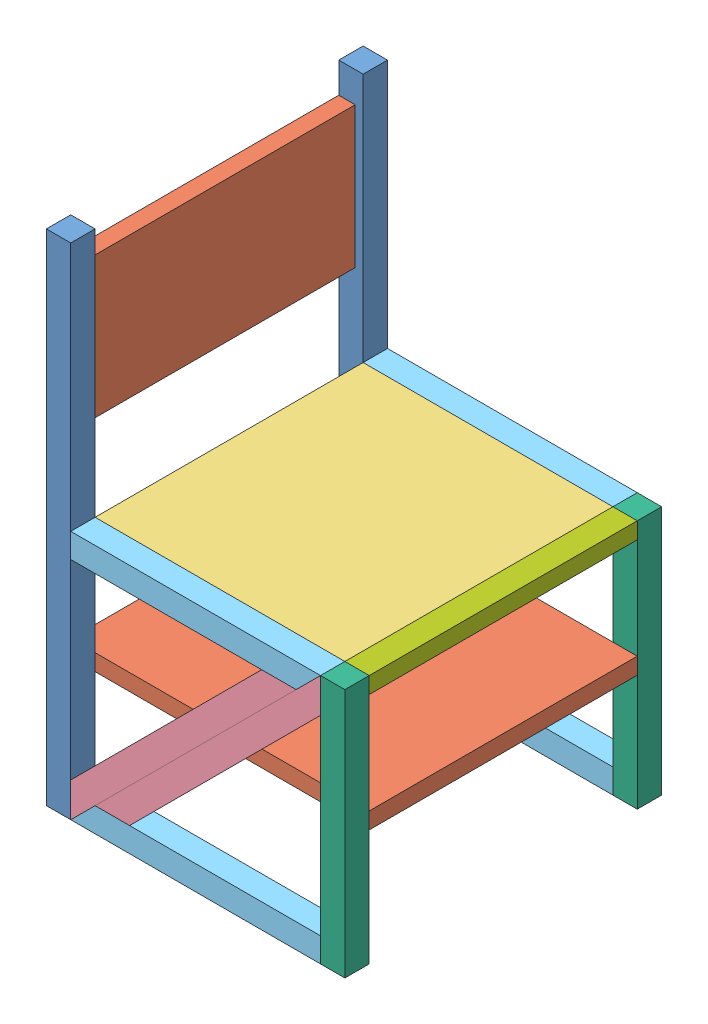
SolidWorks assembly montage animation.SLDASM, configuration Défaut (file format 7000). Lengths in mm.
Overall size (615.48 931.33 520).
19 component instances, 7 part files, 4 mates.
Components (placement in the parent):
- PARTIE MOBILE-1: PARTIE MOBILE.SLDASM [Défaut] at (271.4456 1355.9928 -665.5456) x (-1 0 0) z (0 0 1) size (450 820 520)
  - montant partie mobile-1: montant partie mobile.SLDPRT [Défaut] at (-165.2031 846.3507 -83.4097) x (-1 0 0) z (0 0 1) size (40 820 40)
  - PLATEFORME-1: PLATEFORME.SLDPRT [Défaut] at (66.2969 -142.1493 -563.4097) x (0 1 0) z (0 0 1) size (231.5 27 440)
  - ASSISE-1: ASSISE.SLDPRT [Défaut] at (-165.2031 463.3507 -603.4097) x (-1 0 0) z (0 1 0) size (410 440 27)
  - PLATEFORME-2: PLATEFORME.SLDPRT [Défaut] at (93.2969 847.3507 -563.4097) x (-1 0 0) z (0 0 1) size (231.5 27 440)
  - diagonle-2: diagonle.SLDPRT [Défaut] at (-575.2031 436.3507 -83.4097) size (370 370 40)
  - longeron-1: longeron.SLDPRT [Défaut] at (-575.2031 436.3507 -83.4097) size (410 40 40)
  - montant partie mobile-3: montant partie mobile.SLDPRT [Défaut] at (-165.2031 846.3507 -563.4097) x (-1 0 0) z (0 0 1) size (40 820 40)
  - diagonle-3: diagonle.SLDPRT [Défaut] at (-575.2031 436.3507 -563.4097) size (370 370 40)
  - longeron-2: longeron.SLDPRT [Défaut] at (-575.2031 436.3507 -563.4097) size (410 40 40)
- PARTIE FIXE^montage animation-1: PARTIE FIXE^montage animation.sldasm [Défaut] at (345.3756 628.2227 -748.9553) x (0.966698 -0.255919 0) z (0 0 1) size (501.27 511.51 520) (virtual)
  - longeron-1: longeron.SLDPRT [Défaut] at (118.5806 -91.2731 0) x (0.966698 0.255919 0) z (0 0 1) size (410 40 40)
  - diagonle-1: diagonle.SLDPRT [Défaut] at (118.5806 -91.2731 0) x (0.966698 0.255919 0) z (0 0 1) size (370 370 40)
  - MONTANT PARTIE fixe-1: MONTANT PARTIE fixe.SLDPRT [Défaut] at (118.5806 -91.2731 0) x (0.966698 0.255919 0) z (0 0 1) size (40 410 40)
  - MONTANT PARTIE fixe-2: MONTANT PARTIE fixe.SLDPRT [Défaut] at (118.5806 -91.2731 -480) x (0.966698 0.255919 0) z (0 0 1) size (40 410 40)
  - diagonle-2: diagonle.SLDPRT [Défaut] at (118.5806 -91.2731 -480) x (0.966698 0.255919 0) z (0 0 1) size (370 370 40)
  - longeron-2: longeron.SLDPRT [Défaut] at (118.5806 -91.2731 -480) x (0.966698 0.255919 0) z (0 0 1) size (410 40 40)
  - BARRE-1: BARRE.SLDPRT [Défaut] at (20.5636 278.9723 -520) x (0.966698 0.255919 0) z (0.255919 -0.966698 0) size (40 440 27)
  - PLATEFORME-1: PLATEFORME.SLDPRT [Défaut] at (118.8365 -92.2398 -480) x (0.966698 0.255919 0) z (0 0 1) size (231.5 27 440)
Mates (geometry in assembly coordinates):
- Coïncidente32: coincident: plane of PARTIE FIXE^montage animation-1/diagonle-1 through (436.6487 509.6421 -748.9553) normal (0 0 1); plane of ? through (391.6436 560.2394 -748.9553) normal (0 0 1)
- Coïncidente49: coincident anti-aligned: line of ? through (846.6487 946.6421 -748.9553) axis (0 0 -1); line of ? through (846.6487 946.6421 -1268.9553) axis (0 0 1)
- Coïncidente50: coincident: line of PARTIE MOBILE-1/ASSISE-1 through (846.6487 919.6421 -1228.9553) axis (0 0 1); line of PARTIE FIXE^montage animation-1/BARRE-1 through (846.6487 919.6421 -788.9553) axis (0 0 -1)
- Coïncidente52: coincident: plane of PARTIE MOBILE-1/longeron-1 through (846.6487 919.6421 -748.9553) normal (0 0 1); plane of PARTIE FIXE^montage animation-1/MONTANT PARTIE fixe-1 through (436.6487 509.6421 -748.9553) normal (0 0 1)
